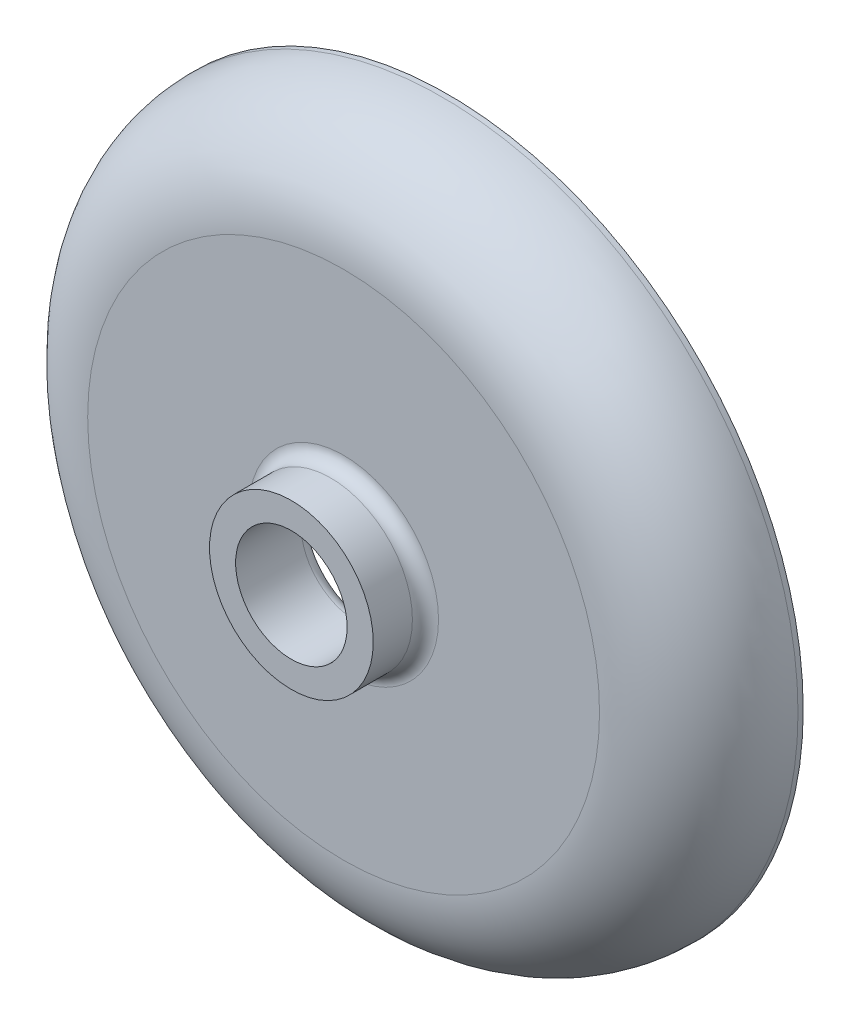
from build123d import *

# Parameters (mm, degrees)
SKETCH1_R                      = 13.6
DRIVE_SHAFT_PLATE_SHAPE_DEPTH  = 4
PLATE_MAIN_FILLET_R            = 3.8
SKETCH2_R                      = 3.135
PLATE_BOSS_DEPTH               = 2
PLATE_SHELL_T                  = -1
DRIVE_START                    = -2
SKETCH3_R                      = 2.135
DRIVE_PLATE_HOLE_DEPTH         = 2
DRIVE_PLATE_SECONDARY_FILLET_R = 0.5


with BuildPart() as part:
    # Sketch1 → drive shaft plate shape (new body)
    with BuildSketch(Plane.XY):
        Circle(SKETCH1_R)
    extrude(amount=DRIVE_SHAFT_PLATE_SHAPE_DEPTH)

    # plate main fillet
    plate_main_fillet_edges = [part.edges().sort_by_distance(p)[0] for p in [
        (-13.6, 0, 4),
    ]]
    fillet(plate_main_fillet_edges, radius=PLATE_MAIN_FILLET_R)

    # Sketch2 → plate boss (add)
    with BuildSketch(Plane.XY.offset(4)):
        Circle(SKETCH2_R)
    extrude(amount=PLATE_BOSS_DEPTH)

    # plate shell
    plate_shell_openings = [part.faces().sort_by_distance(p)[0] for p in [
        (0, 0, 0),
        (0, 0, 6),
    ]]
    offset(amount=PLATE_SHELL_T, openings=plate_shell_openings, kind=Kind.INTERSECTION)

    # Sketch3 → drive plate hole (cut)
    with BuildSketch(Plane.XY.offset(6).offset(DRIVE_START)):
        Circle(SKETCH3_R)
    extrude(amount=DRIVE_PLATE_HOLE_DEPTH, mode=Mode.SUBTRACT)

    # drive plate secondary fillet
    drive_plate_secondary_fillet_edges = [part.edges().sort_by_distance(p)[0] for p in [
        (-2.135, 0, 3),
        (-3.135, 0, 4),
    ]]
    fillet(drive_plate_secondary_fillet_edges, radius=DRIVE_PLATE_SECONDARY_FILLET_R)


solid = part.part
